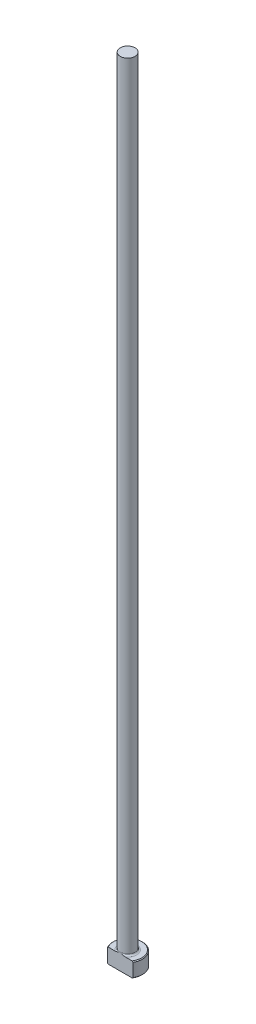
from build123d import *

# Parameters (mm, degrees)
CHAMFER1_SIZE = 0.254
FILLET1_R     = 0.508
KEY_DEPTH     = 255.089281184


with BuildPart() as part:
    # Sketch1 → Revolve1 (revolve)
    with BuildSketch(Plane.XY, mode=Mode.PRIVATE) as revolve1_sk:
        Polygon((0, 0), (-4.7625, 0), (-4.7625, 4.7498), (-2.38125, 4.7498), (-2.38125, 254), (0, 254), align=None)
    revolve(revolve1_sk.sketch.rotate(Axis((0, 259.958771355, 0), (0, -1, 0)), 270), axis=Axis((0, 259.958771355, 0), (0, -1, 0)))

    # Chamfer1
    chamfer1_edges = [part.edges().sort_by_distance(p)[0] for p in [
        (0, 4.7498, -4.7625),
        (0, 0, -4.7625),
    ]]
    chamfer(chamfer1_edges, length=CHAMFER1_SIZE)

    # Fillet1
    fillet1_edges = [part.edges().sort_by_distance(p)[0] for p in [
        (0, 4.7498, -2.38125),
    ]]
    fillet(fillet1_edges, radius=FILLET1_R)

    # Sketch2 → Key (cut, through all)
    with BuildSketch(Plane(origin=(0, 0, 0), x_dir=(1, 0, 0), z_dir=(0, 1, 0))):
        with BuildLine():
            Line((-4.124445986, -2.38125), (4.124445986, -2.38125))
            ThreePointArc((4.124445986, -2.38125), (0, -4.7625), (-4.124445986, -2.38125))
        make_face()
    extrude(amount=KEY_DEPTH, mode=Mode.SUBTRACT)


solid = part.part
